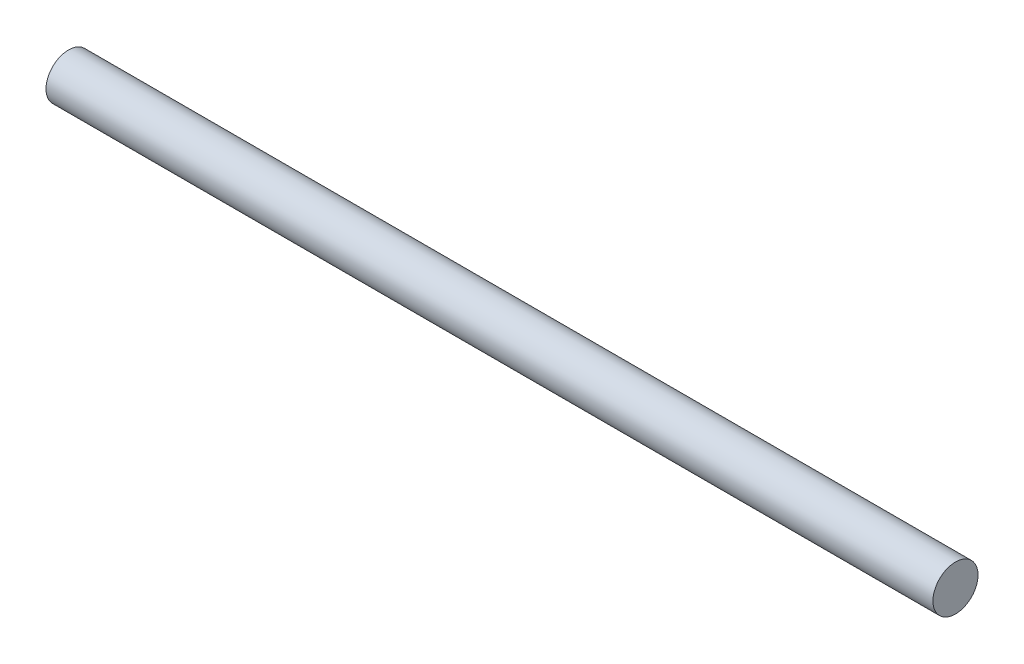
ISO-10303-21;
HEADER;
FILE_DESCRIPTION(('STEP AP214'),'2;1');
FILE_NAME('part.step','',(''),(''),'','','');
FILE_SCHEMA(('AUTOMOTIVE_DESIGN { 1 0 10303 214 1 1 1 1 }'));
ENDSEC;
DATA;
#1=APPLICATION_CONTEXT('core data for automotive mechanical design processes');
#2=APPLICATION_PROTOCOL_DEFINITION('international standard','automotive_design',2000,#1);
#3=PRODUCT_CONTEXT('',#1,'mechanical');
#4=PRODUCT('Part','Part','',(#3));
#5=PRODUCT_RELATED_PRODUCT_CATEGORY('part','',(#4));
#6=PRODUCT_DEFINITION_FORMATION('','',#4);
#7=PRODUCT_DEFINITION_CONTEXT('part definition',#1,'design');
#8=PRODUCT_DEFINITION('design','',#6,#7);
#9=PRODUCT_DEFINITION_SHAPE('','',#8);
#10=(LENGTH_UNIT() NAMED_UNIT(*) SI_UNIT(.MILLI.,.METRE.));
#11=(NAMED_UNIT(*) PLANE_ANGLE_UNIT() SI_UNIT($,.RADIAN.));
#12=(NAMED_UNIT(*) SI_UNIT($,.STERADIAN.) SOLID_ANGLE_UNIT());
#13=UNCERTAINTY_MEASURE_WITH_UNIT(LENGTH_MEASURE(1.E-05),#10,'distance_accuracy_value','');
#14=(GEOMETRIC_REPRESENTATION_CONTEXT(3) GLOBAL_UNCERTAINTY_ASSIGNED_CONTEXT((#13)) GLOBAL_UNIT_ASSIGNED_CONTEXT((#10,
#11,#12)) REPRESENTATION_CONTEXT('',''));
#15=CARTESIAN_POINT('',(0.,0.,0.));
#16=DIRECTION('',(0.,0.,1.));
#17=DIRECTION('',(1.,0.,0.));
#18=AXIS2_PLACEMENT_3D('',#15,#16,#17);
#19=CARTESIAN_POINT('',(0.,0.,0.));
#20=DIRECTION('',(1.,0.,0.));
#21=DIRECTION('',(0.,0.,-1.));
#22=AXIS2_PLACEMENT_3D('',#19,#20,#21);
#23=PLANE('',#22);
#24=CARTESIAN_POINT('',(0.,0.,0.));
#25=DIRECTION('',(-1.,0.,0.));
#26=DIRECTION('',(0.,0.,1.));
#27=AXIS2_PLACEMENT_3D('',#24,#25,#26);
#28=CIRCLE('',#27,27.78125);
#29=CARTESIAN_POINT('',(0.,0.,27.78125));
#30=VERTEX_POINT('',#29);
#31=EDGE_CURVE('E10',#30,#30,#28,.T.);
#32=ORIENTED_EDGE('',*,*,#31,.T.);
#33=EDGE_LOOP('',(#32));
#34=FACE_BOUND('',#33,.T.);
#35=ADVANCED_FACE('F15',(#34),#23,.F.);
#36=CARTESIAN_POINT('',(0.,0.,0.));
#37=DIRECTION('',(-1.,0.,0.));
#38=DIRECTION('',(0.,0.,1.));
#39=AXIS2_PLACEMENT_3D('',#36,#37,#38);
#40=CYLINDRICAL_SURFACE('',#39,27.78125);
#41=ORIENTED_EDGE('',*,*,#31,.F.);
#42=EDGE_LOOP('',(#41));
#43=FACE_BOUND('',#42,.T.);
#44=CARTESIAN_POINT('',(1092.2,0.,0.));
#45=DIRECTION('',(-1.,0.,0.));
#46=DIRECTION('',(0.,0.,1.));
#47=AXIS2_PLACEMENT_3D('',#44,#45,#46);
#48=CIRCLE('',#47,27.78125);
#49=CARTESIAN_POINT('',(1092.2,0.,27.78125));
#50=VERTEX_POINT('',#49);
#51=EDGE_CURVE('E21',#50,#50,#48,.T.);
#52=ORIENTED_EDGE('',*,*,#51,.T.);
#53=EDGE_LOOP('',(#52));
#54=FACE_BOUND('',#53,.T.);
#55=ADVANCED_FACE('F27',(#43,#54),#40,.T.);
#56=CARTESIAN_POINT('',(1092.2,0.,0.));
#57=DIRECTION('',(-1.,0.,0.));
#58=DIRECTION('',(0.,0.,1.));
#59=AXIS2_PLACEMENT_3D('',#56,#57,#58);
#60=PLANE('',#59);
#61=ORIENTED_EDGE('',*,*,#51,.F.);
#62=EDGE_LOOP('',(#61));
#63=FACE_BOUND('',#62,.T.);
#64=ADVANCED_FACE('F29',(#63),#60,.F.);
#65=CLOSED_SHELL('',(#35,#55,#64));
#66=MANIFOLD_SOLID_BREP('B1',#65);
#67=ADVANCED_BREP_SHAPE_REPRESENTATION('',(#18,#66),#14);
#68=SHAPE_DEFINITION_REPRESENTATION(#9,#67);
ENDSEC;
END-ISO-10303-21;
